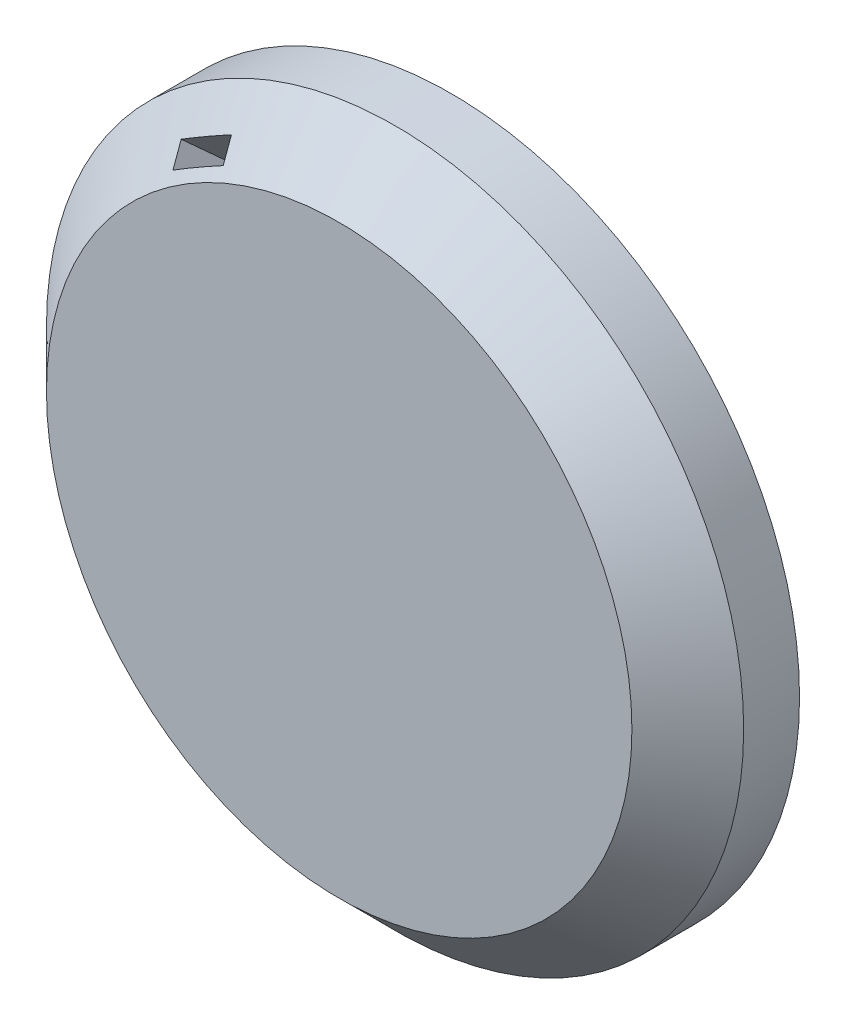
ISO-10303-21;
HEADER;
FILE_DESCRIPTION(('STEP AP214'),'2;1');
FILE_NAME('part.step','',(''),(''),'','','');
FILE_SCHEMA(('AUTOMOTIVE_DESIGN { 1 0 10303 214 1 1 1 1 }'));
ENDSEC;
DATA;
#1=APPLICATION_CONTEXT('core data for automotive mechanical design processes');
#2=APPLICATION_PROTOCOL_DEFINITION('international standard','automotive_design',2000,#1);
#3=PRODUCT_CONTEXT('',#1,'mechanical');
#4=PRODUCT('Part','Part','',(#3));
#5=PRODUCT_RELATED_PRODUCT_CATEGORY('part','',(#4));
#6=PRODUCT_DEFINITION_FORMATION('','',#4);
#7=PRODUCT_DEFINITION_CONTEXT('part definition',#1,'design');
#8=PRODUCT_DEFINITION('design','',#6,#7);
#9=PRODUCT_DEFINITION_SHAPE('','',#8);
#10=(LENGTH_UNIT() NAMED_UNIT(*) SI_UNIT(.MILLI.,.METRE.));
#11=(NAMED_UNIT(*) PLANE_ANGLE_UNIT() SI_UNIT($,.RADIAN.));
#12=(NAMED_UNIT(*) SI_UNIT($,.STERADIAN.) SOLID_ANGLE_UNIT());
#13=UNCERTAINTY_MEASURE_WITH_UNIT(LENGTH_MEASURE(1.E-05),#10,'distance_accuracy_value','');
#14=(GEOMETRIC_REPRESENTATION_CONTEXT(3) GLOBAL_UNCERTAINTY_ASSIGNED_CONTEXT((#13)) GLOBAL_UNIT_ASSIGNED_CONTEXT((#10,
#11,#12)) REPRESENTATION_CONTEXT('',''));
#15=CARTESIAN_POINT('',(0.,0.,0.));
#16=DIRECTION('',(0.,0.,1.));
#17=DIRECTION('',(1.,0.,0.));
#18=AXIS2_PLACEMENT_3D('',#15,#16,#17);
#19=CARTESIAN_POINT('',(0.,0.,-20.));
#20=DIRECTION('',(0.,0.,1.));
#21=DIRECTION('',(1.,0.,0.));
#22=AXIS2_PLACEMENT_3D('',#19,#20,#21);
#23=CYLINDRICAL_SURFACE('',#22,62.3893375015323);
#24=CARTESIAN_POINT('',(0.,0.,-10.));
#25=DIRECTION('',(0.,0.,1.));
#26=DIRECTION('',(1.,0.,0.));
#27=AXIS2_PLACEMENT_3D('',#24,#25,#26);
#28=CIRCLE('',#27,62.3893375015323);
#29=CARTESIAN_POINT('',(62.3893375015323,0.,-10.));
#30=VERTEX_POINT('',#29);
#31=EDGE_CURVE('E114',#30,#30,#28,.F.);
#32=ORIENTED_EDGE('',*,*,#31,.T.);
#33=EDGE_LOOP('',(#32));
#34=FACE_BOUND('',#33,.T.);
#35=CARTESIAN_POINT('',(0.,0.,-20.));
#36=DIRECTION('',(0.,0.,1.));
#37=DIRECTION('',(1.,0.,0.));
#38=AXIS2_PLACEMENT_3D('',#35,#36,#37);
#39=CIRCLE('',#38,62.3893375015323);
#40=CARTESIAN_POINT('',(62.3893375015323,0.,-20.));
#41=VERTEX_POINT('',#40);
#42=EDGE_CURVE('E105',#41,#41,#39,.T.);
#43=ORIENTED_EDGE('',*,*,#42,.T.);
#44=EDGE_LOOP('',(#43));
#45=FACE_BOUND('',#44,.T.);
#46=ADVANCED_FACE('F33',(#34,#45),#23,.T.);
#47=CARTESIAN_POINT('',(0.,0.,-20.));
#48=DIRECTION('',(0.,0.,1.));
#49=DIRECTION('',(1.,0.,0.));
#50=AXIS2_PLACEMENT_3D('',#47,#48,#49);
#51=PLANE('',#50);
#52=ORIENTED_EDGE('',*,*,#42,.F.);
#53=EDGE_LOOP('',(#52));
#54=FACE_BOUND('',#53,.T.);
#55=ADVANCED_FACE('F137',(#54),#51,.F.);
#56=CARTESIAN_POINT('',(0.,0.,0.));
#57=DIRECTION('',(0.,0.,1.));
#58=DIRECTION('',(1.,0.,0.));
#59=AXIS2_PLACEMENT_3D('',#56,#57,#58);
#60=PLANE('',#59);
#61=CARTESIAN_POINT('',(0.,0.,0.));
#62=DIRECTION('',(0.,0.,1.));
#63=DIRECTION('',(1.,0.,0.));
#64=AXIS2_PLACEMENT_3D('',#61,#62,#63);
#65=CIRCLE('',#64,52.3893375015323);
#66=CARTESIAN_POINT('',(52.3893375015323,0.,0.));
#67=VERTEX_POINT('',#66);
#68=EDGE_CURVE('E111',#67,#67,#65,.T.);
#69=ORIENTED_EDGE('',*,*,#68,.T.);
#70=EDGE_LOOP('',(#69));
#71=FACE_BOUND('',#70,.T.);
#72=ADVANCED_FACE('F140',(#71),#60,.T.);
#73=CARTESIAN_POINT('',(0.,0.,0.));
#74=DIRECTION('',(0.,0.,-1.));
#75=DIRECTION('',(-1.,0.,0.));
#76=AXIS2_PLACEMENT_3D('',#73,#74,#75);
#77=CONICAL_SURFACE('',#76,52.3893375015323,0.785398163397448);
#78=CARTESIAN_POINT('',(-31.4464001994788,43.9370195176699,-1.64155893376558));
#79=CARTESIAN_POINT('',(-29.9464954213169,44.9034839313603,-1.55452858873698));
#80=CARTESIAN_POINT('',(-28.4245548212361,45.8316479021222,-1.51168531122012));
#81=CARTESIAN_POINT('',(-25.3366022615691,47.6113747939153,-1.51437289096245));
#82=CARTESIAN_POINT('',(-23.770590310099,48.462937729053,-1.55990373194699));
#83=CARTESIAN_POINT('',(-22.1825425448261,49.2762002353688,-1.64962162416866));
#84=B_SPLINE_CURVE_WITH_KNOTS('',3,(#78,#79,#80,#81,#82,#83),.UNSPECIFIED.,.F.,.F.,(4,2,4),(0.,
5.34945266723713,10.69890434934),.UNSPECIFIED.);
#85=CARTESIAN_POINT('',(-31.3837251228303,43.9773740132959,-1.63794845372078));
#86=VERTEX_POINT('',#85);
#87=CARTESIAN_POINT('',(-22.3936605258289,49.1677902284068,-1.63794845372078));
#88=VERTEX_POINT('',#87);
#89=EDGE_CURVE('E117',#86,#88,#84,.T.);
#90=ORIENTED_EDGE('',*,*,#89,.F.);
#91=CARTESIAN_POINT('',(-32.9251505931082,46.6472012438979,-4.70730798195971));
#92=CARTESIAN_POINT('',(-32.6578024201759,46.1841406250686,-4.1748217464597));
#93=CARTESIAN_POINT('',(-32.3904373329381,45.7210507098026,-3.64236948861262));
#94=CARTESIAN_POINT('',(-31.8556733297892,44.7948122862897,-2.57753292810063));
#95=CARTESIAN_POINT('',(-31.588274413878,44.3316637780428,-2.04514862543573));
#96=CARTESIAN_POINT('',(-31.3208585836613,43.8684859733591,-1.51279830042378));
#97=B_SPLINE_CURVE_WITH_KNOTS('',3,(#91,#92,#93,#94,#95,#96),.UNSPECIFIED.,.F.,.F.,(4,2,4),(0.,
2.26384096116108,4.52768192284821),.UNSPECIFIED.);
#98=CARTESIAN_POINT('',(-32.8658097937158,46.5444199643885,-4.58911880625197));
#99=VERTEX_POINT('',#98);
#100=EDGE_CURVE('E11',#99,#86,#97,.T.);
#101=ORIENTED_EDGE('',*,*,#100,.F.);
#102=CARTESIAN_POINT('',(-23.6768699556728,51.8376174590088,-4.59954522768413));
#103=CARTESIAN_POINT('',(-25.2599191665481,51.0214500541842,-4.51484232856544));
#104=CARTESIAN_POINT('',(-26.8221408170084,50.1690958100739,-4.47189193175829));
#105=CARTESIAN_POINT('',(-29.9049292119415,48.3920135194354,-4.4694961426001));
#106=CARTESIAN_POINT('',(-31.4254959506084,47.4672854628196,-4.51005076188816));
#107=CARTESIAN_POINT('',(-32.9252351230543,46.5063705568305,-4.59235789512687));
#108=B_SPLINE_CURVE_WITH_KNOTS('',3,(#102,#103,#104,#105,#106,#107),.UNSPECIFIED.,.F.,.F.,(4,2,
4),(0.,5.34041204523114,10.6808248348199),.UNSPECIFIED.);
#109=CARTESIAN_POINT('',(-23.8757451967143,51.7348361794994,-4.58911880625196));
#110=VERTEX_POINT('',#109);
#111=EDGE_CURVE('E46',#110,#99,#108,.T.);
#112=ORIENTED_EDGE('',*,*,#111,.F.);
#113=CARTESIAN_POINT('',(-22.3307939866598,49.05890218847,-1.51279830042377));
#114=CARTESIAN_POINT('',(-22.5982098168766,49.5220799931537,-2.04514862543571));
#115=CARTESIAN_POINT('',(-22.8656087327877,49.9852285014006,-2.57753292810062));
#116=CARTESIAN_POINT('',(-23.4003727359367,50.9114669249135,-3.64236948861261));
#117=CARTESIAN_POINT('',(-23.6677378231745,51.3745568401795,-4.17482174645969));
#118=CARTESIAN_POINT('',(-23.9350859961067,51.8376174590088,-4.7073079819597));
#119=B_SPLINE_CURVE_WITH_KNOTS('',3,(#113,#114,#115,#116,#117,#118),.UNSPECIFIED.,.F.,.F.,(4,2,
4),(0.,2.26384096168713,4.52768192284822),.UNSPECIFIED.);
#120=EDGE_CURVE('E123',#88,#110,#119,.T.);
#121=ORIENTED_EDGE('',*,*,#120,.F.);
#122=EDGE_LOOP('',(#90,#101,#112,#121));
#123=FACE_BOUND('',#122,.T.);
#124=ORIENTED_EDGE('',*,*,#31,.F.);
#125=EDGE_LOOP('',(#124));
#126=FACE_BOUND('',#125,.T.);
#127=ORIENTED_EDGE('',*,*,#68,.F.);
#128=EDGE_LOOP('',(#127));
#129=FACE_BOUND('',#128,.T.);
#130=ADVANCED_FACE('F35',(#123,#126,#129),#77,.T.);
#131=CARTESIAN_POINT('',(-28.682394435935,39.2985320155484,-12.9559495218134));
#132=DIRECTION('',(-0.866025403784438,-0.500000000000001,0.));
#133=DIRECTION('',(0.500000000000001,-0.866025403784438,0.));
#134=AXIS2_PLACEMENT_3D('',#131,#132,#133);
#135=PLANE('',#134);
#136=ORIENTED_EDGE('',*,*,#100,.T.);
#137=DIRECTION('',(-0.353553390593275,0.612372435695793,0.707106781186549));
#138=VECTOR('',#137,1.);
#139=CARTESIAN_POINT('',(-27.2035595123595,36.7371147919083,-9.99827967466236));
#140=LINE('',#139,#138);
#141=CARTESIAN_POINT('',(-27.2035595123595,36.7371147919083,-9.99827967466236));
#142=VERTEX_POINT('',#141);
#143=EDGE_CURVE('E78',#142,#86,#140,.T.);
#144=ORIENTED_EDGE('',*,*,#143,.F.);
#145=DIRECTION('',(0.353553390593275,-0.612372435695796,0.707106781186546));
#146=VECTOR('',#145,1.);
#147=CARTESIAN_POINT('',(-28.682394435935,39.2985320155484,-12.9559495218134));
#148=LINE('',#147,#146);
#149=CARTESIAN_POINT('',(-28.682394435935,39.2985320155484,-12.9559495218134));
#150=VERTEX_POINT('',#149);
#151=EDGE_CURVE('E82',#150,#142,#148,.T.);
#152=ORIENTED_EDGE('',*,*,#151,.F.);
#153=DIRECTION('',(-0.353553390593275,0.612372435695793,0.707106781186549));
#154=VECTOR('',#153,1.);
#155=CARTESIAN_POINT('',(-28.682394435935,39.2985320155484,-12.9559495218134));
#156=LINE('',#155,#154);
#157=EDGE_CURVE('E103',#150,#99,#156,.T.);
#158=ORIENTED_EDGE('',*,*,#157,.T.);
#159=EDGE_LOOP('',(#136,#144,#152,#158));
#160=FACE_BOUND('',#159,.T.);
#161=ADVANCED_FACE('F80',(#160),#135,.F.);
#162=CARTESIAN_POINT('',(-19.6923298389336,44.4889482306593,-12.9559495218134));
#163=DIRECTION('',(-0.353553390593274,0.612372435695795,-0.707106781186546));
#164=DIRECTION('',(0.,0.755928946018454,0.654653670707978));
#165=AXIS2_PLACEMENT_3D('',#162,#163,#164);
#166=PLANE('',#165);
#167=DIRECTION('',(-0.353553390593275,0.612372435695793,0.707106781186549));
#168=VECTOR('',#167,1.);
#169=CARTESIAN_POINT('',(-19.6923298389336,44.4889482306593,-12.9559495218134));
#170=LINE('',#169,#168);
#171=CARTESIAN_POINT('',(-19.6923298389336,44.4889482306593,-12.9559495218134));
#172=VERTEX_POINT('',#171);
#173=EDGE_CURVE('E106',#172,#110,#170,.T.);
#174=ORIENTED_EDGE('',*,*,#173,.T.);
#175=ORIENTED_EDGE('',*,*,#111,.T.);
#176=ORIENTED_EDGE('',*,*,#157,.F.);
#177=DIRECTION('',(-0.866025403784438,-0.500000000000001,0.));
#178=VECTOR('',#177,1.);
#179=CARTESIAN_POINT('',(-19.6923298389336,44.4889482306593,-12.9559495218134));
#180=LINE('',#179,#178);
#181=EDGE_CURVE('E86',#172,#150,#180,.T.);
#182=ORIENTED_EDGE('',*,*,#181,.F.);
#183=EDGE_LOOP('',(#174,#175,#176,#182));
#184=FACE_BOUND('',#183,.T.);
#185=ADVANCED_FACE('F136',(#184),#166,.F.);
#186=CARTESIAN_POINT('',(-18.2134949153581,41.9275310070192,-9.99827967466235));
#187=DIRECTION('',(0.866025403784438,0.500000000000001,0.));
#188=DIRECTION('',(-0.500000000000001,0.866025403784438,0.));
#189=AXIS2_PLACEMENT_3D('',#186,#187,#188);
#190=PLANE('',#189);
#191=ORIENTED_EDGE('',*,*,#120,.T.);
#192=ORIENTED_EDGE('',*,*,#173,.F.);
#193=DIRECTION('',(-0.353553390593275,0.612372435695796,-0.707106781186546));
#194=VECTOR('',#193,1.);
#195=CARTESIAN_POINT('',(-18.2134949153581,41.9275310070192,-9.99827967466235));
#196=LINE('',#195,#194);
#197=CARTESIAN_POINT('',(-18.2134949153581,41.9275310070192,-9.99827967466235));
#198=VERTEX_POINT('',#197);
#199=EDGE_CURVE('E95',#198,#172,#196,.T.);
#200=ORIENTED_EDGE('',*,*,#199,.F.);
#201=DIRECTION('',(-0.353553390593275,0.612372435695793,0.707106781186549));
#202=VECTOR('',#201,1.);
#203=CARTESIAN_POINT('',(-18.2134949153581,41.9275310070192,-9.99827967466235));
#204=LINE('',#203,#202);
#205=EDGE_CURVE('E85',#198,#88,#204,.T.);
#206=ORIENTED_EDGE('',*,*,#205,.T.);
#207=EDGE_LOOP('',(#191,#192,#200,#206));
#208=FACE_BOUND('',#207,.T.);
#209=ADVANCED_FACE('F130',(#208),#190,.F.);
#210=CARTESIAN_POINT('',(-27.2035595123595,36.7371147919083,-9.99827967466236));
#211=DIRECTION('',(0.353553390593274,-0.612372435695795,0.707106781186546));
#212=DIRECTION('',(0.,-0.755928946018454,-0.654653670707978));
#213=AXIS2_PLACEMENT_3D('',#210,#211,#212);
#214=PLANE('',#213);
#215=ORIENTED_EDGE('',*,*,#143,.T.);
#216=ORIENTED_EDGE('',*,*,#89,.T.);
#217=ORIENTED_EDGE('',*,*,#205,.F.);
#218=DIRECTION('',(0.866025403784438,0.500000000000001,0.));
#219=VECTOR('',#218,1.);
#220=CARTESIAN_POINT('',(-27.2035595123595,36.7371147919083,-9.99827967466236));
#221=LINE('',#220,#219);
#222=EDGE_CURVE('E89',#142,#198,#221,.T.);
#223=ORIENTED_EDGE('',*,*,#222,.F.);
#224=EDGE_LOOP('',(#215,#216,#217,#223));
#225=FACE_BOUND('',#224,.T.);
#226=ADVANCED_FACE('F90',(#225),#214,.F.);
#227=CARTESIAN_POINT('',(-27.2035595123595,36.7371147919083,-9.99827967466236));
#228=DIRECTION('',(-0.353553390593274,0.612372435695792,0.707106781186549));
#229=DIRECTION('',(0.,-0.755928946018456,0.654653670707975));
#230=AXIS2_PLACEMENT_3D('',#227,#228,#229);
#231=PLANE('',#230);
#232=ORIENTED_EDGE('',*,*,#151,.T.);
#233=ORIENTED_EDGE('',*,*,#222,.T.);
#234=ORIENTED_EDGE('',*,*,#199,.T.);
#235=ORIENTED_EDGE('',*,*,#181,.T.);
#236=EDGE_LOOP('',(#232,#233,#234,#235));
#237=FACE_BOUND('',#236,.T.);
#238=ADVANCED_FACE('F97',(#237),#231,.T.);
#239=CLOSED_SHELL('',(#46,#55,#72,#130,#161,#185,#209,#226,#238));
#240=MANIFOLD_SOLID_BREP('B2',#239);
#241=ADVANCED_BREP_SHAPE_REPRESENTATION('',(#18,#240),#14);
#242=SHAPE_DEFINITION_REPRESENTATION(#9,#241);
ENDSEC;
END-ISO-10303-21;
